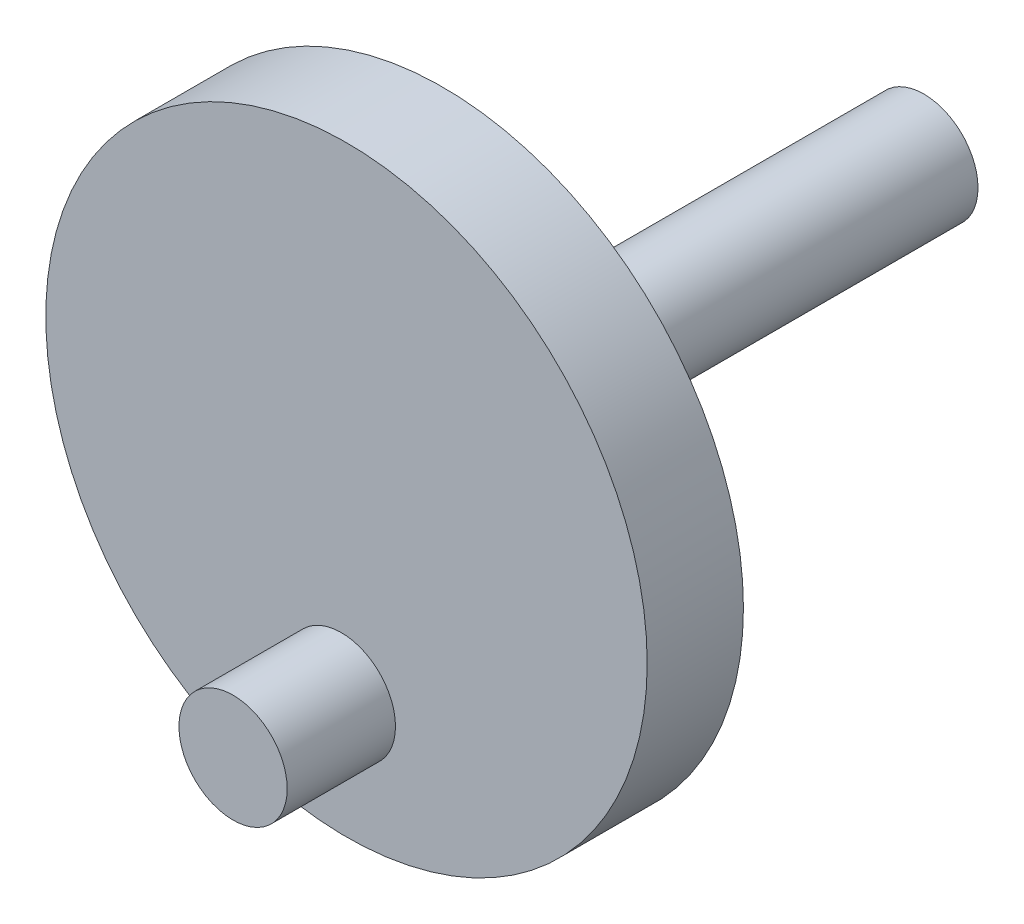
ISO-10303-21;
HEADER;
FILE_DESCRIPTION(('STEP AP214'),'2;1');
FILE_NAME('part.step','',(''),(''),'','','');
FILE_SCHEMA(('AUTOMOTIVE_DESIGN { 1 0 10303 214 1 1 1 1 }'));
ENDSEC;
DATA;
#1=APPLICATION_CONTEXT('core data for automotive mechanical design processes');
#2=APPLICATION_PROTOCOL_DEFINITION('international standard','automotive_design',2000,#1);
#3=PRODUCT_CONTEXT('',#1,'mechanical');
#4=PRODUCT('Part','Part','',(#3));
#5=PRODUCT_RELATED_PRODUCT_CATEGORY('part','',(#4));
#6=PRODUCT_DEFINITION_FORMATION('','',#4);
#7=PRODUCT_DEFINITION_CONTEXT('part definition',#1,'design');
#8=PRODUCT_DEFINITION('design','',#6,#7);
#9=PRODUCT_DEFINITION_SHAPE('','',#8);
#10=(LENGTH_UNIT() NAMED_UNIT(*) SI_UNIT(.MILLI.,.METRE.));
#11=(NAMED_UNIT(*) PLANE_ANGLE_UNIT() SI_UNIT($,.RADIAN.));
#12=(NAMED_UNIT(*) SI_UNIT($,.STERADIAN.) SOLID_ANGLE_UNIT());
#13=UNCERTAINTY_MEASURE_WITH_UNIT(LENGTH_MEASURE(1.E-05),#10,'distance_accuracy_value','');
#14=(GEOMETRIC_REPRESENTATION_CONTEXT(3) GLOBAL_UNCERTAINTY_ASSIGNED_CONTEXT((#13)) GLOBAL_UNIT_ASSIGNED_CONTEXT((#10,
#11,#12)) REPRESENTATION_CONTEXT('',''));
#15=CARTESIAN_POINT('',(0.,0.,0.));
#16=DIRECTION('',(0.,0.,1.));
#17=DIRECTION('',(1.,0.,0.));
#18=AXIS2_PLACEMENT_3D('',#15,#16,#17);
#19=CARTESIAN_POINT('',(0.,0.,0.));
#20=DIRECTION('',(0.,0.,1.));
#21=DIRECTION('',(1.,0.,0.));
#22=AXIS2_PLACEMENT_3D('',#19,#20,#21);
#23=PLANE('',#22);
#24=CARTESIAN_POINT('',(0.,0.,0.));
#25=DIRECTION('',(0.,0.,1.));
#26=DIRECTION('',(1.,0.,0.));
#27=AXIS2_PLACEMENT_3D('',#24,#25,#26);
#28=CIRCLE('',#27,25.);
#29=CARTESIAN_POINT('',(25.,0.,0.));
#30=VERTEX_POINT('',#29);
#31=EDGE_CURVE('E42',#30,#30,#28,.T.);
#32=ORIENTED_EDGE('',*,*,#31,.F.);
#33=EDGE_LOOP('',(#32));
#34=FACE_BOUND('',#33,.T.);
#35=CARTESIAN_POINT('',(0.,0.,0.));
#36=DIRECTION('',(0.,0.,1.));
#37=DIRECTION('',(1.,0.,0.));
#38=AXIS2_PLACEMENT_3D('',#35,#36,#37);
#39=CIRCLE('',#38,4.5);
#40=CARTESIAN_POINT('',(4.5,0.,0.));
#41=VERTEX_POINT('',#40);
#42=EDGE_CURVE('E10',#41,#41,#39,.F.);
#43=ORIENTED_EDGE('',*,*,#42,.F.);
#44=EDGE_LOOP('',(#43));
#45=FACE_BOUND('',#44,.T.);
#46=ADVANCED_FACE('F31',(#34,#45),#23,.F.);
#47=CARTESIAN_POINT('',(0.,0.,8.));
#48=DIRECTION('',(0.,0.,1.));
#49=DIRECTION('',(1.,0.,0.));
#50=AXIS2_PLACEMENT_3D('',#47,#48,#49);
#51=PLANE('',#50);
#52=CARTESIAN_POINT('',(0.,0.,8.));
#53=DIRECTION('',(0.,0.,1.));
#54=DIRECTION('',(1.,0.,0.));
#55=AXIS2_PLACEMENT_3D('',#52,#53,#54);
#56=CIRCLE('',#55,25.);
#57=CARTESIAN_POINT('',(25.,0.,8.));
#58=VERTEX_POINT('',#57);
#59=EDGE_CURVE('E38',#58,#58,#56,.T.);
#60=ORIENTED_EDGE('',*,*,#59,.T.);
#61=EDGE_LOOP('',(#60));
#62=FACE_BOUND('',#61,.T.);
#63=CARTESIAN_POINT('',(-0.429213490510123,-14.9938579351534,8.));
#64=DIRECTION('',(0.,0.,1.));
#65=DIRECTION('',(1.,0.,0.));
#66=AXIS2_PLACEMENT_3D('',#63,#64,#65);
#67=CIRCLE('',#66,4.5);
#68=CARTESIAN_POINT('',(4.07078650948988,-14.9938579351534,8.));
#69=VERTEX_POINT('',#68);
#70=EDGE_CURVE('E49',#69,#69,#67,.T.);
#71=ORIENTED_EDGE('',*,*,#70,.F.);
#72=EDGE_LOOP('',(#71));
#73=FACE_BOUND('',#72,.T.);
#74=ADVANCED_FACE('F73',(#62,#73),#51,.T.);
#75=CARTESIAN_POINT('',(0.,0.,8.));
#76=DIRECTION('',(0.,0.,-1.));
#77=DIRECTION('',(-1.,0.,0.));
#78=AXIS2_PLACEMENT_3D('',#75,#76,#77);
#79=CYLINDRICAL_SURFACE('',#78,25.);
#80=ORIENTED_EDGE('',*,*,#59,.F.);
#81=EDGE_LOOP('',(#80));
#82=FACE_BOUND('',#81,.T.);
#83=ORIENTED_EDGE('',*,*,#31,.T.);
#84=EDGE_LOOP('',(#83));
#85=FACE_BOUND('',#84,.T.);
#86=ADVANCED_FACE('F33',(#82,#85),#79,.T.);
#87=CARTESIAN_POINT('',(-0.429213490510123,-14.9938579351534,17.));
#88=DIRECTION('',(0.,0.,-1.));
#89=DIRECTION('',(-1.,0.,0.));
#90=AXIS2_PLACEMENT_3D('',#87,#88,#89);
#91=CYLINDRICAL_SURFACE('',#90,4.5);
#92=CARTESIAN_POINT('',(-0.429213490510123,-14.9938579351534,17.));
#93=DIRECTION('',(0.,0.,1.));
#94=DIRECTION('',(1.,0.,0.));
#95=AXIS2_PLACEMENT_3D('',#92,#93,#94);
#96=CIRCLE('',#95,4.5);
#97=CARTESIAN_POINT('',(4.07078650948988,-14.9938579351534,17.));
#98=VERTEX_POINT('',#97);
#99=EDGE_CURVE('E47',#98,#98,#96,.T.);
#100=ORIENTED_EDGE('',*,*,#99,.F.);
#101=EDGE_LOOP('',(#100));
#102=FACE_BOUND('',#101,.T.);
#103=ORIENTED_EDGE('',*,*,#70,.T.);
#104=EDGE_LOOP('',(#103));
#105=FACE_BOUND('',#104,.T.);
#106=ADVANCED_FACE('F69',(#102,#105),#91,.T.);
#107=CARTESIAN_POINT('',(-0.429213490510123,-14.9938579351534,17.));
#108=DIRECTION('',(0.,0.,1.));
#109=DIRECTION('',(1.,0.,0.));
#110=AXIS2_PLACEMENT_3D('',#107,#108,#109);
#111=PLANE('',#110);
#112=ORIENTED_EDGE('',*,*,#99,.T.);
#113=EDGE_LOOP('',(#112));
#114=FACE_BOUND('',#113,.T.);
#115=ADVANCED_FACE('F62',(#114),#111,.T.);
#116=CARTESIAN_POINT('',(0.,0.,-40.));
#117=DIRECTION('',(0.,0.,1.));
#118=DIRECTION('',(1.,0.,0.));
#119=AXIS2_PLACEMENT_3D('',#116,#117,#118);
#120=CYLINDRICAL_SURFACE('',#119,4.5);
#121=CARTESIAN_POINT('',(0.,0.,-40.));
#122=DIRECTION('',(0.,0.,-1.));
#123=DIRECTION('',(-1.,0.,0.));
#124=AXIS2_PLACEMENT_3D('',#121,#122,#123);
#125=CIRCLE('',#124,4.5);
#126=CARTESIAN_POINT('',(-4.5,0.,-40.));
#127=VERTEX_POINT('',#126);
#128=EDGE_CURVE('E52',#127,#127,#125,.T.);
#129=ORIENTED_EDGE('',*,*,#128,.F.);
#130=EDGE_LOOP('',(#129));
#131=FACE_BOUND('',#130,.T.);
#132=ORIENTED_EDGE('',*,*,#42,.T.);
#133=EDGE_LOOP('',(#132));
#134=FACE_BOUND('',#133,.T.);
#135=ADVANCED_FACE('F60',(#131,#134),#120,.T.);
#136=CARTESIAN_POINT('',(0.,0.,-40.));
#137=DIRECTION('',(0.,0.,-1.));
#138=DIRECTION('',(-1.,0.,0.));
#139=AXIS2_PLACEMENT_3D('',#136,#137,#138);
#140=PLANE('',#139);
#141=ORIENTED_EDGE('',*,*,#128,.T.);
#142=EDGE_LOOP('',(#141));
#143=FACE_BOUND('',#142,.T.);
#144=ADVANCED_FACE('F58',(#143),#140,.T.);
#145=CLOSED_SHELL('',(#46,#74,#86,#106,#115,#135,#144));
#146=MANIFOLD_SOLID_BREP('B2',#145);
#147=ADVANCED_BREP_SHAPE_REPRESENTATION('',(#18,#146),#14);
#148=SHAPE_DEFINITION_REPRESENTATION(#9,#147);
ENDSEC;
END-ISO-10303-21;
